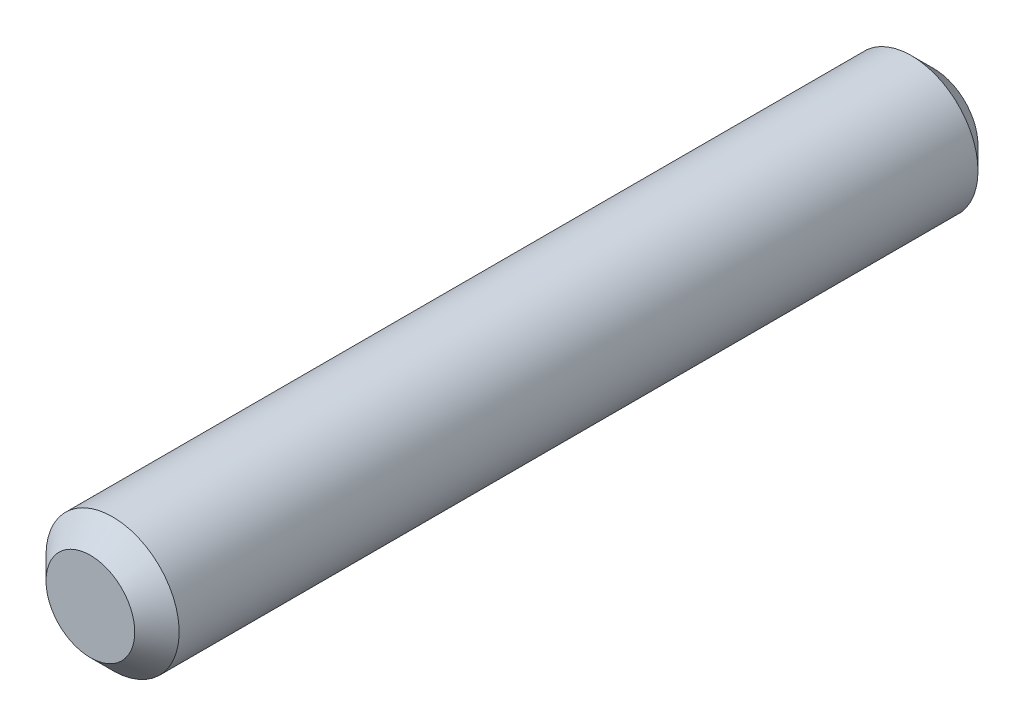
ISO-10303-21;
HEADER;
FILE_DESCRIPTION(('STEP AP214'),'2;1');
FILE_NAME('part.step','',(''),(''),'','','');
FILE_SCHEMA(('AUTOMOTIVE_DESIGN { 1 0 10303 214 1 1 1 1 }'));
ENDSEC;
DATA;
#1=APPLICATION_CONTEXT('core data for automotive mechanical design processes');
#2=APPLICATION_PROTOCOL_DEFINITION('international standard','automotive_design',2000,#1);
#3=PRODUCT_CONTEXT('',#1,'mechanical');
#4=PRODUCT('Part','Part','',(#3));
#5=PRODUCT_RELATED_PRODUCT_CATEGORY('part','',(#4));
#6=PRODUCT_DEFINITION_FORMATION('','',#4);
#7=PRODUCT_DEFINITION_CONTEXT('part definition',#1,'design');
#8=PRODUCT_DEFINITION('design','',#6,#7);
#9=PRODUCT_DEFINITION_SHAPE('','',#8);
#10=(LENGTH_UNIT() NAMED_UNIT(*) SI_UNIT(.MILLI.,.METRE.));
#11=(NAMED_UNIT(*) PLANE_ANGLE_UNIT() SI_UNIT($,.RADIAN.));
#12=(NAMED_UNIT(*) SI_UNIT($,.STERADIAN.) SOLID_ANGLE_UNIT());
#13=UNCERTAINTY_MEASURE_WITH_UNIT(LENGTH_MEASURE(1.E-05),#10,'distance_accuracy_value','');
#14=(GEOMETRIC_REPRESENTATION_CONTEXT(3) GLOBAL_UNCERTAINTY_ASSIGNED_CONTEXT((#13)) GLOBAL_UNIT_ASSIGNED_CONTEXT((#10,
#11,#12)) REPRESENTATION_CONTEXT('',''));
#15=CARTESIAN_POINT('',(0.,0.,0.));
#16=DIRECTION('',(0.,0.,1.));
#17=DIRECTION('',(1.,0.,0.));
#18=AXIS2_PLACEMENT_3D('',#15,#16,#17);
#19=CARTESIAN_POINT('',(0.,0.,48.2599999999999));
#20=DIRECTION('',(0.,0.,-0.999999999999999));
#21=DIRECTION('',(-1.00000000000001,0.,0.));
#22=AXIS2_PLACEMENT_3D('',#19,#20,#21);
#23=CYLINDRICAL_SURFACE('',#22,7.62);
#24=CARTESIAN_POINT('',(0.,0.,-45.7199999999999));
#25=DIRECTION('',(0.,0.,0.999999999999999));
#26=DIRECTION('',(1.00000000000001,0.,0.));
#27=AXIS2_PLACEMENT_3D('',#24,#25,#26);
#28=CIRCLE('',#27,7.62);
#29=CARTESIAN_POINT('',(-7.62000000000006,0.,-45.7199999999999));
#30=VERTEX_POINT('',#29);
#31=EDGE_CURVE('E36',#30,#30,#28,.T.);
#32=CARTESIAN_POINT('',(0.,0.,45.7199999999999));
#33=DIRECTION('',(0.,0.,0.999999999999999));
#34=DIRECTION('',(1.00000000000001,0.,0.));
#35=AXIS2_PLACEMENT_3D('',#32,#33,#34);
#36=CIRCLE('',#35,7.62);
#37=CARTESIAN_POINT('',(-7.62000000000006,0.,45.7199999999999));
#38=VERTEX_POINT('',#37);
#39=EDGE_CURVE('E40',#38,#38,#36,.F.);
#40=CARTESIAN_POINT('',(-7.62000000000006,0.,-45.7199999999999));
#41=CARTESIAN_POINT('',(-7.62000000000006,0.,-44.7674999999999));
#42=CARTESIAN_POINT('',(-7.62000000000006,0.,-43.8149999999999));
#43=CARTESIAN_POINT('',(-7.62000000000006,0.,-41.9099999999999));
#44=CARTESIAN_POINT('',(-7.62000000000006,0.,-40.9574999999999));
#45=CARTESIAN_POINT('',(-7.62000000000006,0.,-39.0524999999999));
#46=CARTESIAN_POINT('',(-7.62000000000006,0.,-38.0999999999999));
#47=CARTESIAN_POINT('',(-7.62000000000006,0.,-36.1949999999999));
#48=CARTESIAN_POINT('',(-7.62000000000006,0.,-35.2424999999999));
#49=CARTESIAN_POINT('',(-7.62000000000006,0.,-33.3374999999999));
#50=CARTESIAN_POINT('',(-7.62000000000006,0.,-32.3849999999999));
#51=CARTESIAN_POINT('',(-7.62000000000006,0.,-30.4799999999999));
#52=CARTESIAN_POINT('',(-7.62000000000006,0.,-29.5274999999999));
#53=CARTESIAN_POINT('',(-7.62000000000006,0.,-27.6224999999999));
#54=CARTESIAN_POINT('',(-7.62000000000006,0.,-26.6699999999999));
#55=CARTESIAN_POINT('',(-7.62000000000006,0.,-24.7649999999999));
#56=CARTESIAN_POINT('',(-7.62000000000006,0.,-23.8124999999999));
#57=CARTESIAN_POINT('',(-7.62000000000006,0.,-21.9075));
#58=CARTESIAN_POINT('',(-7.62000000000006,0.,-20.9549999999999));
#59=CARTESIAN_POINT('',(-7.62000000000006,0.,-19.05));
#60=CARTESIAN_POINT('',(-7.62000000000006,0.,-18.0975));
#61=CARTESIAN_POINT('',(-7.62000000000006,0.,-16.1925));
#62=CARTESIAN_POINT('',(-7.62000000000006,0.,-15.24));
#63=CARTESIAN_POINT('',(-7.62000000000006,0.,-13.335));
#64=CARTESIAN_POINT('',(-7.62000000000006,0.,-12.3825));
#65=CARTESIAN_POINT('',(-7.62000000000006,0.,-10.4775));
#66=CARTESIAN_POINT('',(-7.62000000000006,0.,-9.52499999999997));
#67=CARTESIAN_POINT('',(-7.62000000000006,0.,-7.61999999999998));
#68=CARTESIAN_POINT('',(-7.62000000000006,0.,-6.66749999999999));
#69=CARTESIAN_POINT('',(-7.62000000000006,0.,-4.76249999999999));
#70=CARTESIAN_POINT('',(-7.62000000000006,0.,-3.80999999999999));
#71=CARTESIAN_POINT('',(-7.62000000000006,0.,-1.90499999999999));
#72=CARTESIAN_POINT('',(-7.62000000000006,0.,-0.952499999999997));
#73=CARTESIAN_POINT('',(-7.62000000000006,0.,0.9525));
#74=CARTESIAN_POINT('',(-7.62000000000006,0.,1.905));
#75=CARTESIAN_POINT('',(-7.62000000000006,0.,3.81));
#76=CARTESIAN_POINT('',(-7.62000000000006,0.,4.76249999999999));
#77=CARTESIAN_POINT('',(-7.62000000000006,0.,6.66749999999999));
#78=CARTESIAN_POINT('',(-7.62000000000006,0.,7.61999999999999));
#79=CARTESIAN_POINT('',(-7.62000000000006,0.,9.52499999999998));
#80=CARTESIAN_POINT('',(-7.62000000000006,0.,10.4775));
#81=CARTESIAN_POINT('',(-7.62000000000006,0.,12.3825));
#82=CARTESIAN_POINT('',(-7.62000000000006,0.,13.335));
#83=CARTESIAN_POINT('',(-7.62000000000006,0.,15.24));
#84=CARTESIAN_POINT('',(-7.62000000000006,0.,16.1925));
#85=CARTESIAN_POINT('',(-7.62000000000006,0.,18.0975));
#86=CARTESIAN_POINT('',(-7.62000000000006,0.,19.05));
#87=CARTESIAN_POINT('',(-7.62000000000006,0.,20.955));
#88=CARTESIAN_POINT('',(-7.62000000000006,0.,21.9075));
#89=CARTESIAN_POINT('',(-7.62000000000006,0.,23.8125));
#90=CARTESIAN_POINT('',(-7.62000000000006,0.,24.765));
#91=CARTESIAN_POINT('',(-7.62000000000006,0.,26.6699999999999));
#92=CARTESIAN_POINT('',(-7.62000000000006,0.,27.6224999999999));
#93=CARTESIAN_POINT('',(-7.62000000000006,0.,29.5274999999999));
#94=CARTESIAN_POINT('',(-7.62000000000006,0.,30.4799999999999));
#95=CARTESIAN_POINT('',(-7.62000000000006,0.,32.3849999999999));
#96=CARTESIAN_POINT('',(-7.62000000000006,0.,33.3374999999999));
#97=CARTESIAN_POINT('',(-7.62000000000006,0.,35.2424999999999));
#98=CARTESIAN_POINT('',(-7.62000000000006,0.,36.1949999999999));
#99=CARTESIAN_POINT('',(-7.62000000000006,0.,38.0999999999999));
#100=CARTESIAN_POINT('',(-7.62000000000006,0.,39.0524999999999));
#101=CARTESIAN_POINT('',(-7.62000000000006,0.,40.9574999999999));
#102=CARTESIAN_POINT('',(-7.62000000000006,0.,41.9099999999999));
#103=CARTESIAN_POINT('',(-7.62000000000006,0.,43.8149999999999));
#104=CARTESIAN_POINT('',(-7.62000000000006,0.,44.7674999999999));
#105=CARTESIAN_POINT('',(-7.62000000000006,0.,45.7199999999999));
#106=B_SPLINE_CURVE_WITH_KNOTS('',3,(#40,#41,#42,#43,#44,#45,#46,#47,#48,#49,#50,#51,#52,#53,
#54,#55,#56,#57,#58,#59,#60,#61,#62,#63,#64,#65,#66,#67,#68,#69,#70,#71,#72,#73,#74,#75,#76,#77,
#78,#79,#80,#81,#82,#83,#84,#85,#86,#87,#88,#89,#90,#91,#92,#93,#94,#95,#96,#97,#98,#99,#100,
#101,#102,#103,#104,#105),.UNSPECIFIED.,.F.,.F.,(4,2,2,2,2,2,2,2,2,2,2,2,2,2,2,2,2,2,2,2,2,2,2,
2,2,2,2,2,2,2,2,2,4),(0.,2.8575,5.715,8.5725,11.43,14.2875,17.145,20.0025,22.8599999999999,
25.7174999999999,28.5749999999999,31.4324999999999,34.2899999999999,37.1474999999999,
40.0049999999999,42.8624999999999,45.7199999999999,48.5774999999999,51.4349999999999,
54.2924999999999,57.1499999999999,60.0074999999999,62.8649999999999,65.7224999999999,
68.5799999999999,71.4374999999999,74.2949999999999,77.1524999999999,80.0099999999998,
82.8674999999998,85.7249999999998,88.5824999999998,91.4399999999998),.UNSPECIFIED.);
#107=EDGE_CURVE('BSEAM30',#30,#38,#106,.T.);
#108=ORIENTED_EDGE('',*,*,#31,.T.);
#109=ORIENTED_EDGE('',*,*,#39,.T.);
#110=ORIENTED_EDGE('',*,*,#107,.T.);
#111=ORIENTED_EDGE('',*,*,#107,.F.);
#112=EDGE_LOOP('',(#108,#110,#109,#111));
#113=FACE_BOUND('',#112,.T.);
#114=ADVANCED_FACE('F30',(#113),#23,.T.);
#115=CARTESIAN_POINT('',(0.,0.,48.2599999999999));
#116=DIRECTION('',(0.,0.,0.999999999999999));
#117=DIRECTION('',(1.00000000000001,0.,0.));
#118=AXIS2_PLACEMENT_3D('',#115,#116,#117);
#119=PLANE('',#118);
#120=CARTESIAN_POINT('',(0.,0.,48.2599999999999));
#121=DIRECTION('',(0.,0.,0.999999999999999));
#122=DIRECTION('',(1.00000000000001,0.,0.));
#123=AXIS2_PLACEMENT_3D('',#120,#121,#122);
#124=CIRCLE('',#123,5.07999999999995);
#125=CARTESIAN_POINT('',(-5.08,0.,48.2599999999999));
#126=VERTEX_POINT('',#125);
#127=EDGE_CURVE('E44',#126,#126,#124,.T.);
#128=ORIENTED_EDGE('',*,*,#127,.T.);
#129=EDGE_LOOP('',(#128));
#130=FACE_BOUND('',#129,.T.);
#131=ADVANCED_FACE('F50',(#130),#119,.T.);
#132=CARTESIAN_POINT('',(0.,0.,-48.2599999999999));
#133=DIRECTION('',(0.,0.,0.999999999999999));
#134=DIRECTION('',(1.00000000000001,0.,0.));
#135=AXIS2_PLACEMENT_3D('',#132,#133,#134);
#136=PLANE('',#135);
#137=CARTESIAN_POINT('',(0.,0.,-48.2599999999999));
#138=DIRECTION('',(0.,0.,0.999999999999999));
#139=DIRECTION('',(1.00000000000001,0.,0.));
#140=AXIS2_PLACEMENT_3D('',#137,#138,#139);
#141=CIRCLE('',#140,5.07999999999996);
#142=CARTESIAN_POINT('',(5.08,0.,-48.2599999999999));
#143=VERTEX_POINT('',#142);
#144=EDGE_CURVE('E10',#143,#143,#141,.F.);
#145=ORIENTED_EDGE('',*,*,#144,.T.);
#146=EDGE_LOOP('',(#145));
#147=FACE_BOUND('',#146,.T.);
#148=ADVANCED_FACE('F55',(#147),#136,.F.);
#149=CARTESIAN_POINT('',(0.,0.,48.2599999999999));
#150=DIRECTION('',(0.,0.,-0.999999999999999));
#151=DIRECTION('',(-1.00000000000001,0.,0.));
#152=AXIS2_PLACEMENT_3D('',#149,#150,#151);
#153=CONICAL_SURFACE('',#152,5.07999999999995,0.785398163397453);
#154=CARTESIAN_POINT('',(-7.62000000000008,0.,45.7199999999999));
#155=CARTESIAN_POINT('',(-7.59354166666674,0.,45.7464583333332));
#156=CARTESIAN_POINT('',(-7.56708333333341,0.,45.7729166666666));
#157=CARTESIAN_POINT('',(-7.51416666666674,0.,45.8258333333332));
#158=CARTESIAN_POINT('',(-7.48770833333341,0.,45.8522916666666));
#159=CARTESIAN_POINT('',(-7.43479166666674,0.,45.9052083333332));
#160=CARTESIAN_POINT('',(-7.40833333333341,0.,45.9316666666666));
#161=CARTESIAN_POINT('',(-7.35541666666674,0.,45.9845833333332));
#162=CARTESIAN_POINT('',(-7.3289583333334,0.,46.0110416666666));
#163=CARTESIAN_POINT('',(-7.27604166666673,0.,46.0639583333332));
#164=CARTESIAN_POINT('',(-7.2495833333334,0.,46.0904166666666));
#165=CARTESIAN_POINT('',(-7.19666666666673,0.,46.1433333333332));
#166=CARTESIAN_POINT('',(-7.1702083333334,0.,46.1697916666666));
#167=CARTESIAN_POINT('',(-7.11729166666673,0.,46.2227083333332));
#168=CARTESIAN_POINT('',(-7.09083333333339,0.,46.2491666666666));
#169=CARTESIAN_POINT('',(-7.03791666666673,0.,46.3020833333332));
#170=CARTESIAN_POINT('',(-7.01145833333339,0.,46.3285416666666));
#171=CARTESIAN_POINT('',(-6.95854166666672,0.,46.3814583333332));
#172=CARTESIAN_POINT('',(-6.93208333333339,0.,46.4079166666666));
#173=CARTESIAN_POINT('',(-6.87916666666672,0.,46.4608333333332));
#174=CARTESIAN_POINT('',(-6.85270833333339,0.,46.4872916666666));
#175=CARTESIAN_POINT('',(-6.79979166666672,0.,46.5402083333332));
#176=CARTESIAN_POINT('',(-6.77333333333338,0.,46.5666666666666));
#177=CARTESIAN_POINT('',(-6.72041666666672,0.,46.6195833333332));
#178=CARTESIAN_POINT('',(-6.69395833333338,0.,46.6460416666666));
#179=CARTESIAN_POINT('',(-6.64104166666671,0.,46.6989583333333));
#180=CARTESIAN_POINT('',(-6.61458333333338,0.,46.7254166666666));
#181=CARTESIAN_POINT('',(-6.56166666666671,0.,46.7783333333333));
#182=CARTESIAN_POINT('',(-6.53520833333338,0.,46.8047916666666));
#183=CARTESIAN_POINT('',(-6.48229166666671,0.,46.8577083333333));
#184=CARTESIAN_POINT('',(-6.45583333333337,0.,46.8841666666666));
#185=CARTESIAN_POINT('',(-6.40291666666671,0.,46.9370833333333));
#186=CARTESIAN_POINT('',(-6.37645833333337,0.,46.9635416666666));
#187=CARTESIAN_POINT('',(-6.3235416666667,0.,47.0164583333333));
#188=CARTESIAN_POINT('',(-6.29708333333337,0.,47.0429166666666));
#189=CARTESIAN_POINT('',(-6.2441666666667,0.,47.0958333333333));
#190=CARTESIAN_POINT('',(-6.21770833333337,0.,47.1222916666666));
#191=CARTESIAN_POINT('',(-6.1647916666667,0.,47.1752083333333));
#192=CARTESIAN_POINT('',(-6.13833333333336,0.,47.2016666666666));
#193=CARTESIAN_POINT('',(-6.0854166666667,0.,47.2545833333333));
#194=CARTESIAN_POINT('',(-6.05895833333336,0.,47.2810416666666));
#195=CARTESIAN_POINT('',(-6.00604166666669,0.,47.3339583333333));
#196=CARTESIAN_POINT('',(-5.97958333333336,0.,47.3604166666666));
#197=CARTESIAN_POINT('',(-5.92666666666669,0.,47.4133333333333));
#198=CARTESIAN_POINT('',(-5.90020833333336,0.,47.4397916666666));
#199=CARTESIAN_POINT('',(-5.84729166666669,0.,47.4927083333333));
#200=CARTESIAN_POINT('',(-5.82083333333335,0.,47.5191666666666));
#201=CARTESIAN_POINT('',(-5.76791666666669,0.,47.5720833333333));
#202=CARTESIAN_POINT('',(-5.74145833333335,0.,47.5985416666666));
#203=CARTESIAN_POINT('',(-5.68854166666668,0.,47.6514583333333));
#204=CARTESIAN_POINT('',(-5.66208333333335,0.,47.6779166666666));
#205=CARTESIAN_POINT('',(-5.60916666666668,0.,47.7308333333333));
#206=CARTESIAN_POINT('',(-5.58270833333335,0.,47.7572916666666));
#207=CARTESIAN_POINT('',(-5.52979166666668,0.,47.8102083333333));
#208=CARTESIAN_POINT('',(-5.50333333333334,0.,47.8366666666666));
#209=CARTESIAN_POINT('',(-5.45041666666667,0.,47.8895833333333));
#210=CARTESIAN_POINT('',(-5.42395833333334,0.,47.9160416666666));
#211=CARTESIAN_POINT('',(-5.37104166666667,0.,47.9689583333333));
#212=CARTESIAN_POINT('',(-5.34458333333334,0.,47.9954166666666));
#213=CARTESIAN_POINT('',(-5.29166666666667,0.,48.0483333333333));
#214=CARTESIAN_POINT('',(-5.26520833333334,0.,48.0747916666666));
#215=CARTESIAN_POINT('',(-5.21229166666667,0.,48.1277083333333));
#216=CARTESIAN_POINT('',(-5.18583333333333,0.,48.1541666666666));
#217=CARTESIAN_POINT('',(-5.13291666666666,0.,48.2070833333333));
#218=CARTESIAN_POINT('',(-5.10645833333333,0.,48.2335416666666));
#219=CARTESIAN_POINT('',(-5.08,0.,48.2599999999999));
#220=B_SPLINE_CURVE_WITH_KNOTS('',3,(#154,#155,#156,#157,#158,#159,#160,#161,#162,#163,#164,
#165,#166,#167,#168,#169,#170,#171,#172,#173,#174,#175,#176,#177,#178,#179,#180,#181,#182,#183,
#184,#185,#186,#187,#188,#189,#190,#191,#192,#193,#194,#195,#196,#197,#198,#199,#200,#201,#202,
#203,#204,#205,#206,#207,#208,#209,#210,#211,#212,#213,#214,#215,#216,#217,#218,#219),
.UNSPECIFIED.,.F.,.F.,(4,2,2,2,2,2,2,2,2,2,2,2,2,2,2,2,2,2,2,2,2,2,2,2,2,2,2,2,2,2,2,2,4),(0.,
0.112253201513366,0.224506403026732,0.336759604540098,0.449012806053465,0.561266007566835,
0.673519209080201,0.785772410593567,0.898025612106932,1.0102788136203,1.12253201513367,
1.23478521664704,1.3470384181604,1.45929161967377,1.57154482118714,1.6837980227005,
1.79605122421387,1.90830442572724,2.0205576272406,2.13281082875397,2.24506403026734,
2.3573172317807,2.46957043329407,2.58182363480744,2.69407683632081,2.80633003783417,
2.91858323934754,3.03083644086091,3.14308964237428,3.25534284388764,3.36759604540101,
3.47984924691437,3.59210244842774),.UNSPECIFIED.);
#221=EDGE_CURVE('BSEAM52',#38,#126,#220,.T.);
#222=ORIENTED_EDGE('',*,*,#39,.F.);
#223=ORIENTED_EDGE('',*,*,#127,.F.);
#224=ORIENTED_EDGE('',*,*,#221,.T.);
#225=ORIENTED_EDGE('',*,*,#221,.F.);
#226=EDGE_LOOP('',(#222,#224,#223,#225));
#227=FACE_BOUND('',#226,.T.);
#228=ADVANCED_FACE('F52',(#227),#153,.T.);
#229=CARTESIAN_POINT('',(0.,0.,-45.7199999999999));
#230=DIRECTION('',(0.,0.,0.999999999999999));
#231=DIRECTION('',(1.00000000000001,0.,0.));
#232=AXIS2_PLACEMENT_3D('',#229,#230,#231);
#233=CONICAL_SURFACE('',#232,7.62,0.78539816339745);
#234=ORIENTED_EDGE('',*,*,#144,.F.);
#235=EDGE_LOOP('',(#234));
#236=FACE_BOUND('',#235,.T.);
#237=ORIENTED_EDGE('',*,*,#31,.F.);
#238=EDGE_LOOP('',(#237));
#239=FACE_BOUND('',#238,.T.);
#240=ADVANCED_FACE('F54',(#236,#239),#233,.T.);
#241=CLOSED_SHELL('',(#114,#131,#148,#228,#240));
#242=MANIFOLD_SOLID_BREP('B2',#241);
#243=ADVANCED_BREP_SHAPE_REPRESENTATION('',(#18,#242),#14);
#244=SHAPE_DEFINITION_REPRESENTATION(#9,#243);
ENDSEC;
END-ISO-10303-21;
